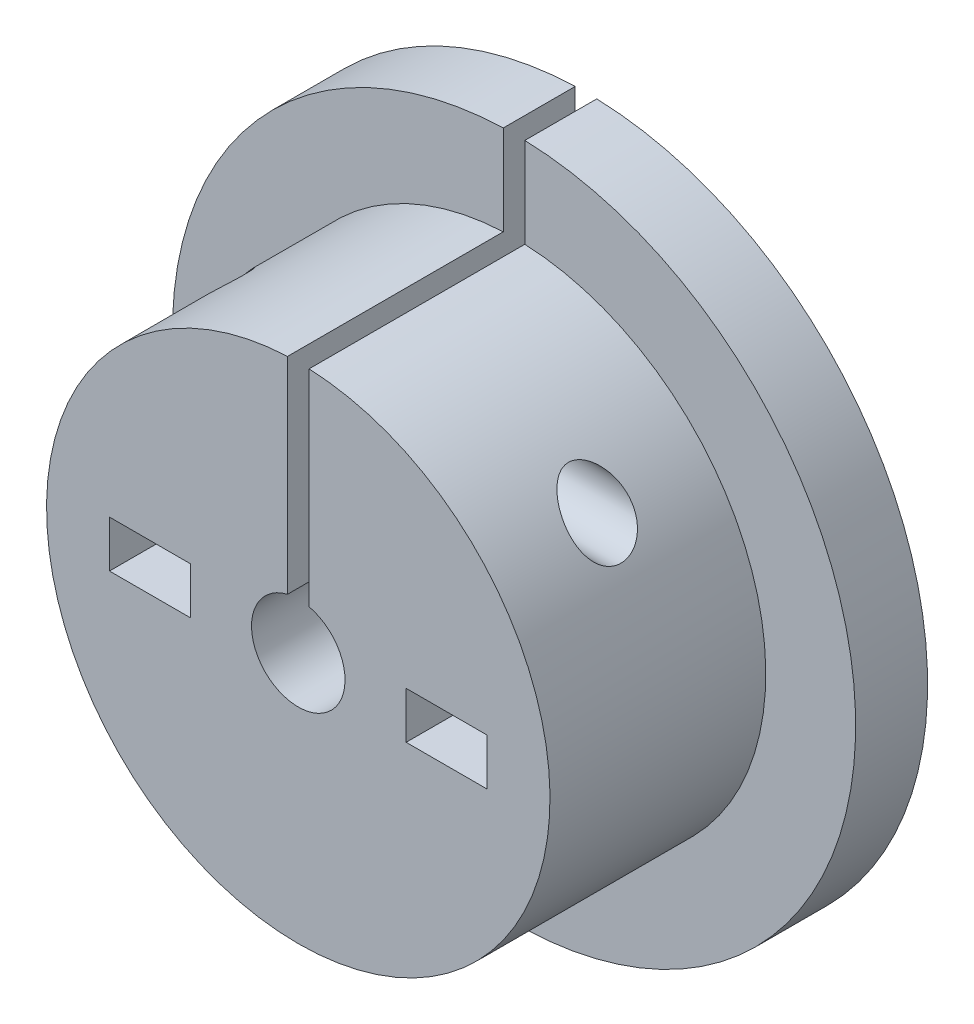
from build123d import *

# Parameters (mm, degrees)
SKETCH_1_R                                       = 19
HORN_FLANGE_D38_DEPTH                            = 4
SKETCH_2_R                                       = 14
SHAFT_CLAMP_HUB_DEPTH                            = 16
SHAFT_D5P2_DEPTH                                 = 32.272991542
SHAFT_D5P2_DEPTH_BACK                            = 32.272991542
SKETCH_3_R                                       = 2.6
CLAMP_SPLIT_DEPTH                                = 32.272991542
CLAMP_SPLIT_DEPTH_BACK                           = 32.272991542
SKETCH_4_W                                       = 1.2
SKETCH_4_H                                       = 17.8
HORN_TWO_ADJUSTMENT_SLOTS_VERIFY_HORN_DEPTH      = 32.272991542
HORN_TWO_ADJUSTMENT_SLOTS_VERIFY_HORN_DEPTH_BACK = 32.272991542
SKETCH_5_W                                       = 4.5
SKETCH_5_H                                       = 2.6
COUPLER_CLAMP_M3_DEPTH                           = 32.272991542
COUPLER_CLAMP_M3_DEPTH_BACK                      = 32.272991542
SKETCH_6_R                                       = 1.7


with BuildPart() as part:
    # Sketch 1 → Horn_flange_D38 (new body)
    with BuildSketch(Plane.XY):
        Circle(SKETCH_1_R)
    extrude(amount=HORN_FLANGE_D38_DEPTH)

    # Sketch 2 → Shaft_clamp_hub (add)
    with BuildSketch(Plane.XY):
        Circle(SKETCH_2_R)
    extrude(amount=SHAFT_CLAMP_HUB_DEPTH)

    # Sketch 3 → Shaft_D5p2 (cut, two sides: drawn at the far end of the back side and taken through both)
    with BuildSketch(Plane.XY.offset(-SHAFT_D5P2_DEPTH_BACK)):
        Circle(SKETCH_3_R)
    extrude(amount=SHAFT_D5P2_DEPTH + SHAFT_D5P2_DEPTH_BACK, mode=Mode.SUBTRACT)

    # Sketch 4 → Clamp_split (cut, two sides: drawn at the far end of the back side and taken through both)
    with BuildSketch(Plane.XY.offset(-CLAMP_SPLIT_DEPTH_BACK)):
        with Locations((0, 11.1)):
            Rectangle(SKETCH_4_W, SKETCH_4_H)
    extrude(amount=CLAMP_SPLIT_DEPTH + CLAMP_SPLIT_DEPTH_BACK, mode=Mode.SUBTRACT)

    # Sketch 5 → Horn_two_adjustment_slots_VERIFY_HORN (cut, two sides: drawn at the far end of the back side and taken through both)
    with BuildSketch(Plane.XY.offset(-HORN_TWO_ADJUSTMENT_SLOTS_VERIFY_HORN_DEPTH_BACK)):
        with Locations((-8.25, 0)):
            Rectangle(SKETCH_5_W, SKETCH_5_H)
        with Locations((8.25, 0)):
            Rectangle(SKETCH_5_W, SKETCH_5_H)
    extrude(amount=HORN_TWO_ADJUSTMENT_SLOTS_VERIFY_HORN_DEPTH + HORN_TWO_ADJUSTMENT_SLOTS_VERIFY_HORN_DEPTH_BACK, mode=Mode.SUBTRACT)

    # Sketch 6 → Coupler_clamp_M3 (cut, two sides: drawn at the far end of the back side and taken through both)
    with BuildSketch(Plane(origin=(0, 0, 0), x_dir=(0, 0, -1), z_dir=(1, 0, 0)).offset(-COUPLER_CLAMP_M3_DEPTH_BACK)):
        with Locations((-10, 9)):
            Circle(SKETCH_6_R)
    extrude(amount=COUPLER_CLAMP_M3_DEPTH + COUPLER_CLAMP_M3_DEPTH_BACK, mode=Mode.SUBTRACT)


solid = part.part
